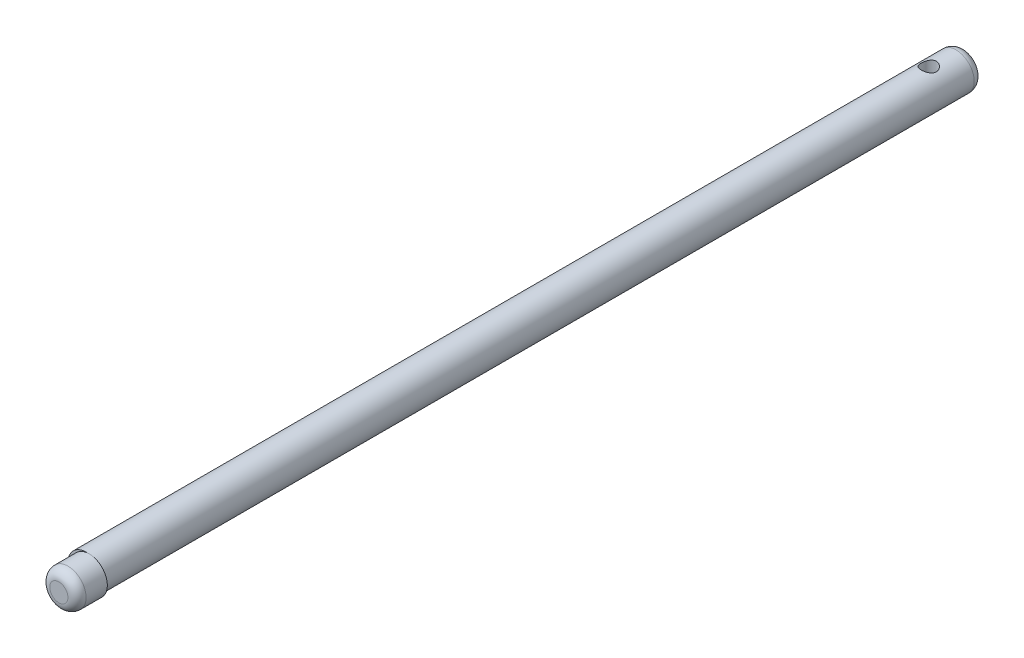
ISO-10303-21;
HEADER;
FILE_DESCRIPTION(('STEP AP214'),'2;1');
FILE_NAME('part.step','',(''),(''),'','','');
FILE_SCHEMA(('AUTOMOTIVE_DESIGN { 1 0 10303 214 1 1 1 1 }'));
ENDSEC;
DATA;
#1=APPLICATION_CONTEXT('core data for automotive mechanical design processes');
#2=APPLICATION_PROTOCOL_DEFINITION('international standard','automotive_design',2000,#1);
#3=PRODUCT_CONTEXT('',#1,'mechanical');
#4=PRODUCT('Part','Part','',(#3));
#5=PRODUCT_RELATED_PRODUCT_CATEGORY('part','',(#4));
#6=PRODUCT_DEFINITION_FORMATION('','',#4);
#7=PRODUCT_DEFINITION_CONTEXT('part definition',#1,'design');
#8=PRODUCT_DEFINITION('design','',#6,#7);
#9=PRODUCT_DEFINITION_SHAPE('','',#8);
#10=(LENGTH_UNIT() NAMED_UNIT(*) SI_UNIT(.MILLI.,.METRE.));
#11=(NAMED_UNIT(*) PLANE_ANGLE_UNIT() SI_UNIT($,.RADIAN.));
#12=(NAMED_UNIT(*) SI_UNIT($,.STERADIAN.) SOLID_ANGLE_UNIT());
#13=UNCERTAINTY_MEASURE_WITH_UNIT(LENGTH_MEASURE(1.E-05),#10,'distance_accuracy_value','');
#14=(GEOMETRIC_REPRESENTATION_CONTEXT(3) GLOBAL_UNCERTAINTY_ASSIGNED_CONTEXT((#13)) GLOBAL_UNIT_ASSIGNED_CONTEXT((#10,
#11,#12)) REPRESENTATION_CONTEXT('',''));
#15=CARTESIAN_POINT('',(0.,0.,0.));
#16=DIRECTION('',(0.,0.,1.));
#17=DIRECTION('',(1.,0.,0.));
#18=AXIS2_PLACEMENT_3D('',#15,#16,#17);
#19=CARTESIAN_POINT('',(0.,0.,145.));
#20=DIRECTION('',(0.,0.,-1.));
#21=DIRECTION('',(-1.,0.,0.));
#22=AXIS2_PLACEMENT_3D('',#19,#20,#21);
#23=CYLINDRICAL_SURFACE('',#22,3.);
#24=CARTESIAN_POINT('',(0.,0.,1.5));
#25=DIRECTION('',(0.,0.,1.));
#26=DIRECTION('',(1.,0.,0.));
#27=AXIS2_PLACEMENT_3D('',#24,#25,#26);
#28=CIRCLE('',#27,3.);
#29=CARTESIAN_POINT('',(3.,0.,1.5));
#30=VERTEX_POINT('',#29);
#31=EDGE_CURVE('E40',#30,#30,#28,.T.);
#32=ORIENTED_EDGE('',*,*,#31,.T.);
#33=EDGE_LOOP('',(#32));
#34=FACE_BOUND('',#33,.T.);
#35=CARTESIAN_POINT('',(0.,-3.,7.25));
#36=CARTESIAN_POINT('',(0.0669580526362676,-2.99999458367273,7.2499927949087));
#37=CARTESIAN_POINT('',(0.134021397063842,-2.9977323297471,7.24458804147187));
#38=CARTESIAN_POINT('',(0.266247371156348,-2.98890153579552,7.22316093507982));
#39=CARTESIAN_POINT('',(0.331404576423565,-2.98232175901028,7.20711087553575));
#40=CARTESIAN_POINT('',(0.457688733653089,-2.96556289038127,7.16508890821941));
#41=CARTESIAN_POINT('',(0.51882852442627,-2.95539599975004,7.13915061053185));
#42=CARTESIAN_POINT('',(0.635829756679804,-2.93245286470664,7.07822717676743));
#43=CARTESIAN_POINT('',(0.691692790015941,-2.91967741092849,7.04324478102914));
#44=CARTESIAN_POINT('',(0.799448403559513,-2.89207828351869,6.96337101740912));
#45=CARTESIAN_POINT('',(0.85104126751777,-2.87718753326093,6.91809869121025));
#46=CARTESIAN_POINT('',(0.946159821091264,-2.84732714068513,6.81973566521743));
#47=CARTESIAN_POINT('',(0.989681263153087,-2.83235746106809,6.76664087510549));
#48=CARTESIAN_POINT('',(1.06953737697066,-2.80321021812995,6.65097322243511));
#49=CARTESIAN_POINT('',(1.10541308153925,-2.78910786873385,6.58806255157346));
#50=CARTESIAN_POINT('',(1.16593940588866,-2.76435572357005,6.45642674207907));
#51=CARTESIAN_POINT('',(1.19059580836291,-2.75370415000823,6.38770462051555));
#52=CARTESIAN_POINT('',(1.22674598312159,-2.73778555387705,6.24984630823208));
#53=CARTESIAN_POINT('',(1.23881657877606,-2.73228387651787,6.18088951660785));
#54=CARTESIAN_POINT('',(1.25125209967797,-2.72661326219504,6.04172670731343));
#55=CARTESIAN_POINT('',(1.25162348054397,-2.7264413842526,5.97152139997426));
#56=CARTESIAN_POINT('',(1.24108450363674,-2.73125119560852,5.83759993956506));
#57=CARTESIAN_POINT('',(1.23103681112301,-2.73583882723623,5.77379890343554));
#58=CARTESIAN_POINT('',(1.20139191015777,-2.74898482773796,5.64888790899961));
#59=CARTESIAN_POINT('',(1.18179287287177,-2.75754395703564,5.58777846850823));
#60=CARTESIAN_POINT('',(1.13321958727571,-2.77786184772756,5.46844229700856));
#61=CARTESIAN_POINT('',(1.10405471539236,-2.78968481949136,5.41030457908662));
#62=CARTESIAN_POINT('',(1.03731242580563,-2.81518331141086,5.29952226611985));
#63=CARTESIAN_POINT('',(0.999731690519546,-2.82885956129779,5.24687984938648));
#64=CARTESIAN_POINT('',(0.913495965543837,-2.85792976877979,5.14390004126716));
#65=CARTESIAN_POINT('',(0.864173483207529,-2.87337121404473,5.09413343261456));
#66=CARTESIAN_POINT('',(0.757729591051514,-2.90325673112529,5.00338649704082));
#67=CARTESIAN_POINT('',(0.700606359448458,-2.9177005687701,4.96240822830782));
#68=CARTESIAN_POINT('',(0.578447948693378,-2.94438283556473,4.88956417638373));
#69=CARTESIAN_POINT('',(0.513260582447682,-2.95656266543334,4.85793055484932));
#70=CARTESIAN_POINT('',(0.377852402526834,-2.97689481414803,4.80627886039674));
#71=CARTESIAN_POINT('',(0.307634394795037,-2.985049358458,4.78625436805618));
#72=CARTESIAN_POINT('',(0.16892811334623,-2.99599641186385,4.75958400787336));
#73=CARTESIAN_POINT('',(0.100611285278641,-2.99909541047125,4.75217214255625));
#74=CARTESIAN_POINT('',(-0.0363546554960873,-3.00056050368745,4.74865377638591));
#75=CARTESIAN_POINT('',(-0.105003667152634,-2.99892795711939,4.752544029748));
#76=CARTESIAN_POINT('',(-0.237098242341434,-2.9913121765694,4.77097108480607));
#77=CARTESIAN_POINT('',(-0.300632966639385,-2.9855488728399,4.7849699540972));
#78=CARTESIAN_POINT('',(-0.424382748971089,-2.97048606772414,4.82246819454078));
#79=CARTESIAN_POINT('',(-0.48459738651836,-2.96118611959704,4.8459687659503));
#80=CARTESIAN_POINT('',(-0.602108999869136,-2.93958270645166,4.90257097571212));
#81=CARTESIAN_POINT('',(-0.659257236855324,-2.92719491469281,4.93594818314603));
#82=CARTESIAN_POINT('',(-0.767346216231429,-2.9007380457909,5.01105337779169));
#83=CARTESIAN_POINT('',(-0.818284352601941,-2.88666826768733,5.05278485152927));
#84=CARTESIAN_POINT('',(-0.916333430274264,-2.85712087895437,5.14690323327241));
#85=CARTESIAN_POINT('',(-0.962910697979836,-2.84161451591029,5.19983850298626));
#86=CARTESIAN_POINT('',(-1.04666984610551,-2.81184336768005,5.31302127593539));
#87=CARTESIAN_POINT('',(-1.08384959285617,-2.79757886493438,5.37327043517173));
#88=CARTESIAN_POINT('',(-1.14815960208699,-2.77181386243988,5.50061417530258));
#89=CARTESIAN_POINT('',(-1.17513918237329,-2.76035562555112,5.56779403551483));
#90=CARTESIAN_POINT('',(-1.21717413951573,-2.74208355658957,5.70637059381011));
#91=CARTESIAN_POINT('',(-1.23223934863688,-2.73526589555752,5.77776376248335));
#92=CARTESIAN_POINT('',(-1.24904080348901,-2.72763164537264,5.91681869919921));
#93=CARTESIAN_POINT('',(-1.25171380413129,-2.72639350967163,5.98434466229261));
#94=CARTESIAN_POINT('',(-1.24615575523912,-2.72893853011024,6.1188428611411));
#95=CARTESIAN_POINT('',(-1.23792637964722,-2.73272091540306,6.18581518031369));
#96=CARTESIAN_POINT('',(-1.21158404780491,-2.74449551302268,6.31409274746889));
#97=CARTESIAN_POINT('',(-1.19394903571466,-2.7522835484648,6.37551667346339));
#98=CARTESIAN_POINT('',(-1.14976328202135,-2.77103181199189,6.49454802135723));
#99=CARTESIAN_POINT('',(-1.12321003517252,-2.78199293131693,6.55215436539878));
#100=CARTESIAN_POINT('',(-1.0601028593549,-2.80666954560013,6.66569589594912));
#101=CARTESIAN_POINT('',(-1.02304360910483,-2.82051102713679,6.72132233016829));
#102=CARTESIAN_POINT('',(-0.940684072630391,-2.84903689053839,6.82586013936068));
#103=CARTESIAN_POINT('',(-0.895380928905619,-2.86372156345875,6.87476917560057));
#104=CARTESIAN_POINT('',(-0.793902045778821,-2.89356392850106,6.96814868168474));
#105=CARTESIAN_POINT('',(-0.737174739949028,-2.90867817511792,7.01203643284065));
#106=CARTESIAN_POINT('',(-0.6166000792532,-2.9366014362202,7.08969945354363));
#107=CARTESIAN_POINT('',(-0.552749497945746,-2.9494093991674,7.12347011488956));
#108=CARTESIAN_POINT('',(-0.420732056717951,-2.97109183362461,7.17920984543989));
#109=CARTESIAN_POINT('',(-0.352653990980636,-2.98002782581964,7.2013647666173));
#110=CARTESIAN_POINT('',(-0.213410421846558,-2.99321009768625,7.23370632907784));
#111=CARTESIAN_POINT('',(-0.142255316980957,-2.99747105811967,7.24393044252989));
#112=CARTESIAN_POINT('',(-0.0472360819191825,-2.99972287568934,7.24933316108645));
#113=CARTESIAN_POINT('',(-0.0236245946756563,-3.00000191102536,7.25000254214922));
#114=CARTESIAN_POINT('',(0.,-3.,7.25));
#115=B_SPLINE_CURVE_WITH_KNOTS('',3,(#35,#36,#37,#38,#39,#40,#41,#42,#43,#44,#45,#46,#47,#48,
#49,#50,#51,#52,#53,#54,#55,#56,#57,#58,#59,#60,#61,#62,#63,#64,#65,#66,#67,#68,#69,#70,#71,#72,
#73,#74,#75,#76,#77,#78,#79,#80,#81,#82,#83,#84,#85,#86,#87,#88,#89,#90,#91,#92,#93,#94,#95,#96,
#97,#98,#99,#100,#101,#102,#103,#104,#105,#106,#107,#108,#109,#110,#111,#112,#113,#114),
.UNSPECIFIED.,.T.,.F.,(4,2,2,2,2,2,2,2,2,2,2,2,2,2,2,2,2,2,2,2,2,2,2,2,2,2,2,2,2,2,2,2,2,2,2,2,
2,2,2,4),(0.,0.200806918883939,0.402138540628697,0.602791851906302,0.803384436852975,
1.01317936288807,1.22308438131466,1.44331724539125,1.66343646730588,1.87295273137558,
2.08235338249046,2.27570157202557,2.46908679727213,2.66658713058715,2.86416545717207,
3.07844141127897,3.29276749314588,3.51204055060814,3.73119224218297,3.93648443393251,
4.14171767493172,4.33676589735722,4.53183876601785,4.73297135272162,4.93418805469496,
5.14978488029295,5.36543061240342,5.58414788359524,5.80268447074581,6.00439877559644,
6.20608211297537,6.39837649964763,6.59072494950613,6.79463893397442,6.99862373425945,
7.2174653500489,7.43640649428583,7.65172855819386,7.86637250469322,7.93722256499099),.UNSPECIFIED.);
#116=CARTESIAN_POINT('',(0.,-3.,7.25));
#117=VERTEX_POINT('',#116);
#118=EDGE_CURVE('E71',#117,#117,#115,.T.);
#119=ORIENTED_EDGE('',*,*,#118,.T.);
#120=EDGE_LOOP('',(#119));
#121=FACE_BOUND('',#120,.T.);
#122=CARTESIAN_POINT('',(0.,3.,7.25));
#123=CARTESIAN_POINT('',(-0.0669580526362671,2.99999458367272,7.2499927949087));
#124=CARTESIAN_POINT('',(-0.134021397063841,2.9977323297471,7.24458804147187));
#125=CARTESIAN_POINT('',(-0.266247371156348,2.98890153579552,7.22316093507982));
#126=CARTESIAN_POINT('',(-0.331404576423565,2.98232175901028,7.20711087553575));
#127=CARTESIAN_POINT('',(-0.457688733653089,2.96556289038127,7.16508890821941));
#128=CARTESIAN_POINT('',(-0.51882852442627,2.95539599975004,7.13915061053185));
#129=CARTESIAN_POINT('',(-0.635829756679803,2.93245286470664,7.07822717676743));
#130=CARTESIAN_POINT('',(-0.69169279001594,2.91967741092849,7.04324478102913));
#131=CARTESIAN_POINT('',(-0.799448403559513,2.89207828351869,6.96337101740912));
#132=CARTESIAN_POINT('',(-0.85104126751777,2.87718753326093,6.91809869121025));
#133=CARTESIAN_POINT('',(-0.946159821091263,2.84732714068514,6.81973566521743));
#134=CARTESIAN_POINT('',(-0.989681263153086,2.83235746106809,6.76664087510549));
#135=CARTESIAN_POINT('',(-1.06953737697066,2.80321021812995,6.6509732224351));
#136=CARTESIAN_POINT('',(-1.10541308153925,2.78910786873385,6.58806255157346));
#137=CARTESIAN_POINT('',(-1.16593940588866,2.76435572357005,6.45642674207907));
#138=CARTESIAN_POINT('',(-1.19059580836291,2.75370415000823,6.38770462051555));
#139=CARTESIAN_POINT('',(-1.22674598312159,2.73778555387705,6.24984630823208));
#140=CARTESIAN_POINT('',(-1.23881657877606,2.73228387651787,6.18088951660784));
#141=CARTESIAN_POINT('',(-1.25125209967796,2.72661326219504,6.04172670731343));
#142=CARTESIAN_POINT('',(-1.25162348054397,2.7264413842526,5.97152139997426));
#143=CARTESIAN_POINT('',(-1.24108450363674,2.73125119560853,5.83759993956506));
#144=CARTESIAN_POINT('',(-1.23103681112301,2.73583882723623,5.77379890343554));
#145=CARTESIAN_POINT('',(-1.20139191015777,2.74898482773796,5.64888790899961));
#146=CARTESIAN_POINT('',(-1.18179287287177,2.75754395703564,5.58777846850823));
#147=CARTESIAN_POINT('',(-1.13321958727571,2.77786184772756,5.46844229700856));
#148=CARTESIAN_POINT('',(-1.10405471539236,2.78968481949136,5.41030457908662));
#149=CARTESIAN_POINT('',(-1.03731242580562,2.81518331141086,5.29952226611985));
#150=CARTESIAN_POINT('',(-0.999731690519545,2.82885956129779,5.24687984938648));
#151=CARTESIAN_POINT('',(-0.913495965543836,2.85792976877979,5.14390004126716));
#152=CARTESIAN_POINT('',(-0.864173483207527,2.87337121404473,5.09413343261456));
#153=CARTESIAN_POINT('',(-0.757729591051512,2.90325673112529,5.00338649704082));
#154=CARTESIAN_POINT('',(-0.700606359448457,2.9177005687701,4.96240822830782));
#155=CARTESIAN_POINT('',(-0.578447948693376,2.94438283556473,4.88956417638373));
#156=CARTESIAN_POINT('',(-0.51326058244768,2.95656266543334,4.85793055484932));
#157=CARTESIAN_POINT('',(-0.377852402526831,2.97689481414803,4.80627886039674));
#158=CARTESIAN_POINT('',(-0.307634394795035,2.985049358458,4.78625436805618));
#159=CARTESIAN_POINT('',(-0.168928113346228,2.99599641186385,4.75958400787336));
#160=CARTESIAN_POINT('',(-0.100611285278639,2.99909541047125,4.75217214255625));
#161=CARTESIAN_POINT('',(0.0363546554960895,3.00056050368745,4.74865377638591));
#162=CARTESIAN_POINT('',(0.105003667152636,2.99892795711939,4.752544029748));
#163=CARTESIAN_POINT('',(0.237098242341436,2.9913121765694,4.77097108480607));
#164=CARTESIAN_POINT('',(0.300632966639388,2.98554887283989,4.7849699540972));
#165=CARTESIAN_POINT('',(0.424382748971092,2.97048606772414,4.82246819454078));
#166=CARTESIAN_POINT('',(0.484597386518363,2.96118611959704,4.8459687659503));
#167=CARTESIAN_POINT('',(0.602108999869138,2.93958270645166,4.90257097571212));
#168=CARTESIAN_POINT('',(0.659257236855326,2.92719491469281,4.93594818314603));
#169=CARTESIAN_POINT('',(0.767346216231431,2.9007380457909,5.01105337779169));
#170=CARTESIAN_POINT('',(0.818284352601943,2.88666826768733,5.05278485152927));
#171=CARTESIAN_POINT('',(0.916333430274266,2.85712087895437,5.14690323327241));
#172=CARTESIAN_POINT('',(0.962910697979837,2.84161451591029,5.19983850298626));
#173=CARTESIAN_POINT('',(1.04666984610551,2.81184336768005,5.31302127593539));
#174=CARTESIAN_POINT('',(1.08384959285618,2.79757886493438,5.37327043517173));
#175=CARTESIAN_POINT('',(1.14815960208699,2.77181386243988,5.50061417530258));
#176=CARTESIAN_POINT('',(1.17513918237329,2.76035562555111,5.56779403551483));
#177=CARTESIAN_POINT('',(1.21717413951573,2.74208355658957,5.70637059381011));
#178=CARTESIAN_POINT('',(1.23223934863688,2.73526589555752,5.77776376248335));
#179=CARTESIAN_POINT('',(1.24904080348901,2.72763164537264,5.91681869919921));
#180=CARTESIAN_POINT('',(1.25171380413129,2.72639350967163,5.98434466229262));
#181=CARTESIAN_POINT('',(1.24615575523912,2.72893853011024,6.1188428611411));
#182=CARTESIAN_POINT('',(1.23792637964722,2.73272091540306,6.1858151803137));
#183=CARTESIAN_POINT('',(1.21158404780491,2.74449551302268,6.31409274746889));
#184=CARTESIAN_POINT('',(1.19394903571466,2.7522835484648,6.37551667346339));
#185=CARTESIAN_POINT('',(1.14976328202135,2.77103181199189,6.49454802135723));
#186=CARTESIAN_POINT('',(1.12321003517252,2.78199293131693,6.55215436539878));
#187=CARTESIAN_POINT('',(1.0601028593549,2.80666954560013,6.66569589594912));
#188=CARTESIAN_POINT('',(1.02304360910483,2.82051102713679,6.72132233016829));
#189=CARTESIAN_POINT('',(0.940684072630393,2.84903689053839,6.82586013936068));
#190=CARTESIAN_POINT('',(0.895380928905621,2.86372156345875,6.87476917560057));
#191=CARTESIAN_POINT('',(0.793902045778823,2.89356392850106,6.96814868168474));
#192=CARTESIAN_POINT('',(0.737174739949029,2.90867817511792,7.01203643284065));
#193=CARTESIAN_POINT('',(0.6166000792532,2.9366014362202,7.08969945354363));
#194=CARTESIAN_POINT('',(0.552749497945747,2.9494093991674,7.12347011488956));
#195=CARTESIAN_POINT('',(0.420732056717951,2.97109183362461,7.17920984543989));
#196=CARTESIAN_POINT('',(0.352653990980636,2.98002782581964,7.2013647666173));
#197=CARTESIAN_POINT('',(0.213410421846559,2.99321009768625,7.23370632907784));
#198=CARTESIAN_POINT('',(0.142255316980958,2.99747105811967,7.24393044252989));
#199=CARTESIAN_POINT('',(0.0472360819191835,2.99972287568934,7.24933316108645));
#200=CARTESIAN_POINT('',(0.0236245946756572,3.00000191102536,7.25000254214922));
#201=CARTESIAN_POINT('',(0.,3.,7.25));
#202=B_SPLINE_CURVE_WITH_KNOTS('',3,(#122,#123,#124,#125,#126,#127,#128,#129,#130,#131,#132,
#133,#134,#135,#136,#137,#138,#139,#140,#141,#142,#143,#144,#145,#146,#147,#148,#149,#150,#151,
#152,#153,#154,#155,#156,#157,#158,#159,#160,#161,#162,#163,#164,#165,#166,#167,#168,#169,#170,
#171,#172,#173,#174,#175,#176,#177,#178,#179,#180,#181,#182,#183,#184,#185,#186,#187,#188,#189,
#190,#191,#192,#193,#194,#195,#196,#197,#198,#199,#200,#201),.UNSPECIFIED.,.T.,.F.,(4,2,2,2,2,2,
2,2,2,2,2,2,2,2,2,2,2,2,2,2,2,2,2,2,2,2,2,2,2,2,2,2,2,2,2,2,2,2,2,4),(0.,0.200806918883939,
0.402138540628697,0.602791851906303,0.803384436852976,1.01317936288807,1.22308438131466,
1.44331724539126,1.66343646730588,1.87295273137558,2.08235338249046,2.27570157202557,
2.46908679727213,2.66658713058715,2.86416545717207,3.07844141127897,3.29276749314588,
3.51204055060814,3.73119224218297,3.93648443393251,4.14171767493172,4.33676589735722,
4.53183876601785,4.73297135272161,4.93418805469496,5.14978488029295,5.36543061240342,
5.58414788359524,5.80268447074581,6.00439877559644,6.20608211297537,6.39837649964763,
6.59072494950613,6.79463893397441,6.99862373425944,7.2174653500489,7.43640649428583,
7.65172855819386,7.86637250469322,7.93722256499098),.UNSPECIFIED.);
#203=CARTESIAN_POINT('',(0.,3.,7.25));
#204=VERTEX_POINT('',#203);
#205=EDGE_CURVE('E53',#204,#204,#202,.T.);
#206=ORIENTED_EDGE('',*,*,#205,.T.);
#207=EDGE_LOOP('',(#206));
#208=FACE_BOUND('',#207,.T.);
#209=CARTESIAN_POINT('',(0.,0.,145.));
#210=DIRECTION('',(0.,0.,1.));
#211=DIRECTION('',(1.,0.,0.));
#212=AXIS2_PLACEMENT_3D('',#209,#210,#211);
#213=CIRCLE('',#212,3.);
#214=CARTESIAN_POINT('',(0.25,2.98956518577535,145.));
#215=VERTEX_POINT('',#214);
#216=CARTESIAN_POINT('',(0.25,-2.98956518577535,145.));
#217=VERTEX_POINT('',#216);
#218=EDGE_CURVE('E48',#215,#217,#213,.T.);
#219=ORIENTED_EDGE('',*,*,#218,.F.);
#220=EDGE_CURVE('E54',#217,#215,#213,.T.);
#221=ORIENTED_EDGE('',*,*,#220,.F.);
#222=EDGE_LOOP('',(#219,#221));
#223=FACE_BOUND('',#222,.T.);
#224=ADVANCED_FACE('F32',(#34,#121,#208,#223),#23,.T.);
#225=CARTESIAN_POINT('',(0.,0.,145.));
#226=DIRECTION('',(0.,0.,1.));
#227=DIRECTION('',(1.,0.,0.));
#228=AXIS2_PLACEMENT_3D('',#225,#226,#227);
#229=PLANE('',#228);
#230=CARTESIAN_POINT('',(0.5,0.,145.));
#231=DIRECTION('',(0.,0.,1.));
#232=DIRECTION('',(1.,0.,0.));
#233=AXIS2_PLACEMENT_3D('',#230,#231,#232);
#234=CIRCLE('',#233,3.);
#235=EDGE_CURVE('E46',#215,#217,#234,.T.);
#236=ORIENTED_EDGE('',*,*,#235,.F.);
#237=ORIENTED_EDGE('',*,*,#218,.T.);
#238=EDGE_LOOP('',(#236,#237));
#239=FACE_BOUND('',#238,.T.);
#240=ADVANCED_FACE('F50',(#239),#229,.T.);
#241=CARTESIAN_POINT('',(0.,0.,0.));
#242=DIRECTION('',(0.,0.,1.));
#243=DIRECTION('',(1.,0.,0.));
#244=AXIS2_PLACEMENT_3D('',#241,#242,#243);
#245=PLANE('',#244);
#246=CARTESIAN_POINT('',(0.,0.,0.));
#247=DIRECTION('',(0.,0.,1.));
#248=DIRECTION('',(1.,0.,0.));
#249=AXIS2_PLACEMENT_3D('',#246,#247,#248);
#250=CIRCLE('',#249,1.5);
#251=CARTESIAN_POINT('',(1.5,0.,0.));
#252=VERTEX_POINT('',#251);
#253=EDGE_CURVE('E11',#252,#252,#250,.F.);
#254=ORIENTED_EDGE('',*,*,#253,.T.);
#255=EDGE_LOOP('',(#254));
#256=FACE_BOUND('',#255,.T.);
#257=ADVANCED_FACE('F82',(#256),#245,.F.);
#258=CARTESIAN_POINT('',(0.,-3.,6.));
#259=DIRECTION('',(0.,1.,0.));
#260=DIRECTION('',(0.,0.,1.));
#261=AXIS2_PLACEMENT_3D('',#258,#259,#260);
#262=CYLINDRICAL_SURFACE('',#261,1.25);
#263=ORIENTED_EDGE('',*,*,#205,.F.);
#264=EDGE_LOOP('',(#263));
#265=FACE_BOUND('',#264,.T.);
#266=ORIENTED_EDGE('',*,*,#118,.F.);
#267=EDGE_LOOP('',(#266));
#268=FACE_BOUND('',#267,.T.);
#269=ADVANCED_FACE('F77',(#265,#268),#262,.F.);
#270=CARTESIAN_POINT('',(0.5,0.,145.));
#271=DIRECTION('',(0.,0.,1.));
#272=DIRECTION('',(1.,0.,0.));
#273=AXIS2_PLACEMENT_3D('',#270,#271,#272);
#274=PLANE('',#273);
#275=EDGE_CURVE('E59',#217,#215,#234,.T.);
#276=ORIENTED_EDGE('',*,*,#275,.F.);
#277=ORIENTED_EDGE('',*,*,#220,.T.);
#278=EDGE_LOOP('',(#276,#277));
#279=FACE_BOUND('',#278,.T.);
#280=ADVANCED_FACE('F60',(#279),#274,.F.);
#281=CARTESIAN_POINT('',(0.5,0.,150.));
#282=DIRECTION('',(0.,0.,-1.));
#283=DIRECTION('',(-1.,0.,0.));
#284=AXIS2_PLACEMENT_3D('',#281,#282,#283);
#285=CYLINDRICAL_SURFACE('',#284,3.);
#286=CARTESIAN_POINT('',(0.5,0.,148.5));
#287=DIRECTION('',(0.,0.,1.));
#288=DIRECTION('',(1.,0.,0.));
#289=AXIS2_PLACEMENT_3D('',#286,#287,#288);
#290=CIRCLE('',#289,3.);
#291=CARTESIAN_POINT('',(3.5,0.,148.5));
#292=VERTEX_POINT('',#291);
#293=EDGE_CURVE('E105',#292,#292,#290,.F.);
#294=ORIENTED_EDGE('',*,*,#293,.T.);
#295=EDGE_LOOP('',(#294));
#296=FACE_BOUND('',#295,.T.);
#297=ORIENTED_EDGE('',*,*,#235,.T.);
#298=ORIENTED_EDGE('',*,*,#275,.T.);
#299=EDGE_LOOP('',(#297,#298));
#300=FACE_BOUND('',#299,.T.);
#301=ADVANCED_FACE('F63',(#296,#300),#285,.T.);
#302=CARTESIAN_POINT('',(0.5,0.,150.));
#303=DIRECTION('',(0.,0.,1.));
#304=DIRECTION('',(1.,0.,0.));
#305=AXIS2_PLACEMENT_3D('',#302,#303,#304);
#306=PLANE('',#305);
#307=CARTESIAN_POINT('',(0.5,0.,150.));
#308=DIRECTION('',(0.,0.,1.));
#309=DIRECTION('',(1.,0.,0.));
#310=AXIS2_PLACEMENT_3D('',#307,#308,#309);
#311=CIRCLE('',#310,1.5);
#312=CARTESIAN_POINT('',(2.,0.,150.));
#313=VERTEX_POINT('',#312);
#314=EDGE_CURVE('E103',#313,#313,#311,.T.);
#315=ORIENTED_EDGE('',*,*,#314,.T.);
#316=EDGE_LOOP('',(#315));
#317=FACE_BOUND('',#316,.T.);
#318=ADVANCED_FACE('F116',(#317),#306,.T.);
#319=CARTESIAN_POINT('',(0.5,0.,148.5));
#320=DIRECTION('',(0.,0.,1.));
#321=DIRECTION('',(1.,0.,0.));
#322=AXIS2_PLACEMENT_3D('',#319,#320,#321);
#323=TOROIDAL_SURFACE('',#322,1.5,1.5);
#324=ORIENTED_EDGE('',*,*,#293,.F.);
#325=EDGE_LOOP('',(#324));
#326=FACE_BOUND('',#325,.T.);
#327=ORIENTED_EDGE('',*,*,#314,.F.);
#328=EDGE_LOOP('',(#327));
#329=FACE_BOUND('',#328,.T.);
#330=ADVANCED_FACE('F113',(#326,#329),#323,.T.);
#331=CARTESIAN_POINT('',(0.,0.,1.5));
#332=DIRECTION('',(0.,0.,1.));
#333=DIRECTION('',(1.,0.,0.));
#334=AXIS2_PLACEMENT_3D('',#331,#332,#333);
#335=TOROIDAL_SURFACE('',#334,1.5,1.5);
#336=ORIENTED_EDGE('',*,*,#253,.F.);
#337=EDGE_LOOP('',(#336));
#338=FACE_BOUND('',#337,.T.);
#339=ORIENTED_EDGE('',*,*,#31,.F.);
#340=EDGE_LOOP('',(#339));
#341=FACE_BOUND('',#340,.T.);
#342=ADVANCED_FACE('F34',(#338,#341),#335,.T.);
#343=CLOSED_SHELL('',(#224,#240,#257,#269,#280,#301,#318,#330,#342));
#344=MANIFOLD_SOLID_BREP('B2',#343);
#345=ADVANCED_BREP_SHAPE_REPRESENTATION('',(#18,#344),#14);
#346=SHAPE_DEFINITION_REPRESENTATION(#9,#345);
ENDSEC;
END-ISO-10303-21;
